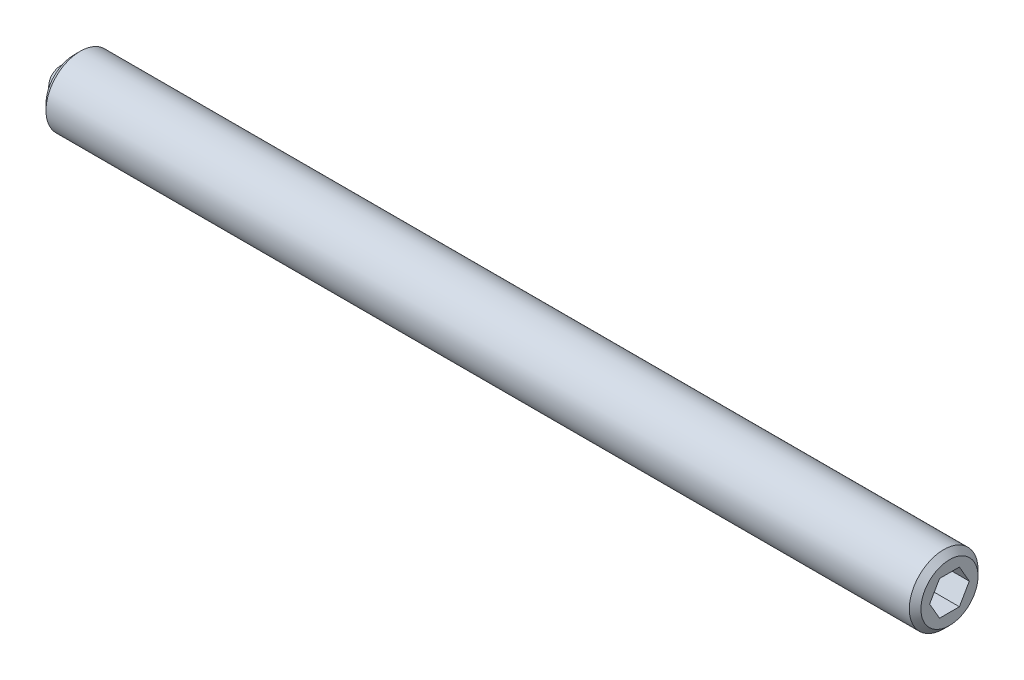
ISO-10303-21;
HEADER;
FILE_DESCRIPTION(('STEP AP214'),'2;1');
FILE_NAME('part.step','',(''),(''),'','','');
FILE_SCHEMA(('AUTOMOTIVE_DESIGN { 1 0 10303 214 1 1 1 1 }'));
ENDSEC;
DATA;
#1=APPLICATION_CONTEXT('core data for automotive mechanical design processes');
#2=APPLICATION_PROTOCOL_DEFINITION('international standard','automotive_design',2000,#1);
#3=PRODUCT_CONTEXT('',#1,'mechanical');
#4=PRODUCT('Part','Part','',(#3));
#5=PRODUCT_RELATED_PRODUCT_CATEGORY('part','',(#4));
#6=PRODUCT_DEFINITION_FORMATION('','',#4);
#7=PRODUCT_DEFINITION_CONTEXT('part definition',#1,'design');
#8=PRODUCT_DEFINITION('design','',#6,#7);
#9=PRODUCT_DEFINITION_SHAPE('','',#8);
#10=(LENGTH_UNIT() NAMED_UNIT(*) SI_UNIT(.MILLI.,.METRE.));
#11=(NAMED_UNIT(*) PLANE_ANGLE_UNIT() SI_UNIT($,.RADIAN.));
#12=(NAMED_UNIT(*) SI_UNIT($,.STERADIAN.) SOLID_ANGLE_UNIT());
#13=UNCERTAINTY_MEASURE_WITH_UNIT(LENGTH_MEASURE(1.E-05),#10,'distance_accuracy_value','');
#14=(GEOMETRIC_REPRESENTATION_CONTEXT(3) GLOBAL_UNCERTAINTY_ASSIGNED_CONTEXT((#13)) GLOBAL_UNIT_ASSIGNED_CONTEXT((#10,
#11,#12)) REPRESENTATION_CONTEXT('',''));
#15=CARTESIAN_POINT('',(0.,0.,0.));
#16=DIRECTION('',(0.,0.,1.));
#17=DIRECTION('',(1.,0.,0.));
#18=AXIS2_PLACEMENT_3D('',#15,#16,#17);
#19=CARTESIAN_POINT('',(0.,0.,0.));
#20=DIRECTION('',(0.,-1.,0.));
#21=DIRECTION('',(0.,0.,-1.));
#22=AXIS2_PLACEMENT_3D('',#19,#20,#21);
#23=SPHERICAL_SURFACE('',#22,0.8);
#24=CARTESIAN_POINT('',(0.,-0.8,0.));
#25=VERTEX_POINT('',#24);
#26=VERTEX_LOOP('',#25);
#27=FACE_BOUND('',#26,.T.);
#28=ADVANCED_FACE('F41',(#27),#23,.T.);
#29=CLOSED_SHELL('',(#28));
#30=MANIFOLD_SOLID_BREP('B2',#29);
#31=CARTESIAN_POINT('',(38.2,0.,0.));
#32=DIRECTION('',(-1.,0.,0.));
#33=DIRECTION('',(0.,0.,1.));
#34=AXIS2_PLACEMENT_3D('',#31,#32,#33);
#35=CYLINDRICAL_SURFACE('',#34,1.5);
#36=CARTESIAN_POINT('',(37.946,0.,0.));
#37=DIRECTION('',(1.,0.,0.));
#38=DIRECTION('',(0.,0.,-1.));
#39=AXIS2_PLACEMENT_3D('',#36,#37,#38);
#40=CIRCLE('',#39,1.5);
#41=CARTESIAN_POINT('',(37.946,0.,-1.5));
#42=VERTEX_POINT('',#41);
#43=EDGE_CURVE('E39',#42,#42,#40,.F.);
#44=ORIENTED_EDGE('',*,*,#43,.T.);
#45=EDGE_LOOP('',(#44));
#46=FACE_BOUND('',#45,.T.);
#47=CARTESIAN_POINT('',(0.253999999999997,0.,0.));
#48=DIRECTION('',(1.,0.,0.));
#49=DIRECTION('',(0.,0.,-1.));
#50=AXIS2_PLACEMENT_3D('',#47,#48,#49);
#51=CIRCLE('',#50,1.5);
#52=CARTESIAN_POINT('',(0.253999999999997,0.,-1.5));
#53=VERTEX_POINT('',#52);
#54=EDGE_CURVE('E157',#53,#53,#51,.T.);
#55=ORIENTED_EDGE('',*,*,#54,.T.);
#56=EDGE_LOOP('',(#55));
#57=FACE_BOUND('',#56,.T.);
#58=ADVANCED_FACE('F54',(#46,#57),#35,.T.);
#59=CARTESIAN_POINT('',(38.2,0.,0.));
#60=DIRECTION('',(1.,0.,0.));
#61=DIRECTION('',(0.,0.,-1.));
#62=AXIS2_PLACEMENT_3D('',#59,#60,#61);
#63=PLANE('',#62);
#64=DIRECTION('',(0.,0.866025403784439,-0.5));
#65=VECTOR('',#64,1.);
#66=CARTESIAN_POINT('',(38.2,-0.75,-0.43301270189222));
#67=LINE('',#66,#65);
#68=CARTESIAN_POINT('',(38.2,-0.75,-0.43301270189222));
#69=VERTEX_POINT('',#68);
#70=CARTESIAN_POINT('',(38.2,0.,-0.866025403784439));
#71=VERTEX_POINT('',#70);
#72=EDGE_CURVE('E69',#69,#71,#67,.T.);
#73=ORIENTED_EDGE('',*,*,#72,.F.);
#74=DIRECTION('',(0.,0.,-1.));
#75=VECTOR('',#74,1.);
#76=CARTESIAN_POINT('',(38.2,-0.75,0.433012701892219));
#77=LINE('',#76,#75);
#78=CARTESIAN_POINT('',(38.2,-0.75,0.433012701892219));
#79=VERTEX_POINT('',#78);
#80=EDGE_CURVE('E153',#79,#69,#77,.T.);
#81=ORIENTED_EDGE('',*,*,#80,.F.);
#82=DIRECTION('',(0.,-0.866025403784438,-0.5));
#83=VECTOR('',#82,1.);
#84=CARTESIAN_POINT('',(38.2,0.,0.866025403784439));
#85=LINE('',#84,#83);
#86=CARTESIAN_POINT('',(38.2,0.,0.866025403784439));
#87=VERTEX_POINT('',#86);
#88=EDGE_CURVE('E151',#87,#79,#85,.T.);
#89=ORIENTED_EDGE('',*,*,#88,.F.);
#90=DIRECTION('',(0.,-0.866025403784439,0.5));
#91=VECTOR('',#90,1.);
#92=CARTESIAN_POINT('',(38.2,0.75,0.433012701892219));
#93=LINE('',#92,#91);
#94=CARTESIAN_POINT('',(38.2,0.75,0.433012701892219));
#95=VERTEX_POINT('',#94);
#96=EDGE_CURVE('E117',#95,#87,#93,.T.);
#97=ORIENTED_EDGE('',*,*,#96,.F.);
#98=DIRECTION('',(0.,0.,1.));
#99=VECTOR('',#98,1.);
#100=CARTESIAN_POINT('',(38.2,0.75,-0.433012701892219));
#101=LINE('',#100,#99);
#102=CARTESIAN_POINT('',(38.2,0.75,-0.433012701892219));
#103=VERTEX_POINT('',#102);
#104=EDGE_CURVE('E147',#103,#95,#101,.T.);
#105=ORIENTED_EDGE('',*,*,#104,.F.);
#106=DIRECTION('',(0.,0.866025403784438,0.5));
#107=VECTOR('',#106,1.);
#108=CARTESIAN_POINT('',(38.2,0.,-0.866025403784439));
#109=LINE('',#108,#107);
#110=EDGE_CURVE('E143',#71,#103,#109,.T.);
#111=ORIENTED_EDGE('',*,*,#110,.F.);
#112=EDGE_LOOP('',(#73,#81,#89,#97,#105,#111));
#113=FACE_BOUND('',#112,.T.);
#114=CARTESIAN_POINT('',(38.2,0.,0.));
#115=DIRECTION('',(1.,0.,0.));
#116=DIRECTION('',(0.,0.,-1.));
#117=AXIS2_PLACEMENT_3D('',#114,#115,#116);
#118=CIRCLE('',#117,1.246);
#119=CARTESIAN_POINT('',(38.2,0.,-1.246));
#120=VERTEX_POINT('',#119);
#121=EDGE_CURVE('E62',#120,#120,#118,.T.);
#122=ORIENTED_EDGE('',*,*,#121,.T.);
#123=EDGE_LOOP('',(#122));
#124=FACE_BOUND('',#123,.T.);
#125=ADVANCED_FACE('F170',(#113,#124),#63,.T.);
#126=CARTESIAN_POINT('',(0.,0.,0.));
#127=DIRECTION('',(1.,0.,0.));
#128=DIRECTION('',(0.,0.,-1.));
#129=AXIS2_PLACEMENT_3D('',#126,#127,#128);
#130=PLANE('',#129);
#131=CARTESIAN_POINT('',(0.,0.,0.));
#132=DIRECTION('',(-1.,0.,0.));
#133=DIRECTION('',(0.,0.,1.));
#134=AXIS2_PLACEMENT_3D('',#131,#132,#133);
#135=CIRCLE('',#134,0.8);
#136=CARTESIAN_POINT('',(0.,0.,0.8));
#137=VERTEX_POINT('',#136);
#138=EDGE_CURVE('E225',#137,#137,#135,.T.);
#139=ORIENTED_EDGE('',*,*,#138,.F.);
#140=EDGE_LOOP('',(#139));
#141=FACE_BOUND('',#140,.T.);
#142=CARTESIAN_POINT('',(0.,0.,0.));
#143=DIRECTION('',(1.,0.,0.));
#144=DIRECTION('',(0.,0.,-1.));
#145=AXIS2_PLACEMENT_3D('',#142,#143,#144);
#146=CIRCLE('',#145,1.246);
#147=CARTESIAN_POINT('',(0.,0.,-1.246));
#148=VERTEX_POINT('',#147);
#149=EDGE_CURVE('E165',#148,#148,#146,.F.);
#150=ORIENTED_EDGE('',*,*,#149,.T.);
#151=EDGE_LOOP('',(#150));
#152=FACE_BOUND('',#151,.T.);
#153=ADVANCED_FACE('F182',(#141,#152),#130,.F.);
#154=CARTESIAN_POINT('',(0.253999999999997,0.,0.));
#155=DIRECTION('',(1.,0.,0.));
#156=DIRECTION('',(0.,0.,-1.));
#157=AXIS2_PLACEMENT_3D('',#154,#155,#156);
#158=CONICAL_SURFACE('',#157,1.5,0.785398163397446);
#159=ORIENTED_EDGE('',*,*,#149,.F.);
#160=EDGE_LOOP('',(#159));
#161=FACE_BOUND('',#160,.T.);
#162=ORIENTED_EDGE('',*,*,#54,.F.);
#163=EDGE_LOOP('',(#162));
#164=FACE_BOUND('',#163,.T.);
#165=ADVANCED_FACE('F174',(#161,#164),#158,.T.);
#166=CARTESIAN_POINT('',(38.2,0.,0.));
#167=DIRECTION('',(-1.,0.,0.));
#168=DIRECTION('',(0.,0.,1.));
#169=AXIS2_PLACEMENT_3D('',#166,#167,#168);
#170=CONICAL_SURFACE('',#169,1.246,0.785398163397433);
#171=ORIENTED_EDGE('',*,*,#43,.F.);
#172=EDGE_LOOP('',(#171));
#173=FACE_BOUND('',#172,.T.);
#174=ORIENTED_EDGE('',*,*,#121,.F.);
#175=EDGE_LOOP('',(#174));
#176=FACE_BOUND('',#175,.T.);
#177=ADVANCED_FACE('F56',(#173,#176),#170,.T.);
#178=CARTESIAN_POINT('',(36.2,-0.75,-0.43301270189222));
#179=DIRECTION('',(0.,-0.5,-0.866025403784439));
#180=DIRECTION('',(0.,0.866025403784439,-0.5));
#181=AXIS2_PLACEMENT_3D('',#178,#179,#180);
#182=PLANE('',#181);
#183=ORIENTED_EDGE('',*,*,#72,.T.);
#184=DIRECTION('',(1.,0.,0.));
#185=VECTOR('',#184,1.);
#186=CARTESIAN_POINT('',(36.2,0.,-0.866025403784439));
#187=LINE('',#186,#185);
#188=CARTESIAN_POINT('',(36.2,0.,-0.866025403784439));
#189=VERTEX_POINT('',#188);
#190=EDGE_CURVE('E99',#189,#71,#187,.T.);
#191=ORIENTED_EDGE('',*,*,#190,.F.);
#192=DIRECTION('',(0.,0.866025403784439,-0.5));
#193=VECTOR('',#192,1.);
#194=CARTESIAN_POINT('',(36.2,-0.75,-0.43301270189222));
#195=LINE('',#194,#193);
#196=CARTESIAN_POINT('',(36.2,-0.75,-0.43301270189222));
#197=VERTEX_POINT('',#196);
#198=EDGE_CURVE('E155',#197,#189,#195,.T.);
#199=ORIENTED_EDGE('',*,*,#198,.F.);
#200=DIRECTION('',(1.,0.,0.));
#201=VECTOR('',#200,1.);
#202=CARTESIAN_POINT('',(36.2,-0.75,-0.43301270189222));
#203=LINE('',#202,#201);
#204=EDGE_CURVE('E77',#197,#69,#203,.T.);
#205=ORIENTED_EDGE('',*,*,#204,.T.);
#206=EDGE_LOOP('',(#183,#191,#199,#205));
#207=FACE_BOUND('',#206,.T.);
#208=ADVANCED_FACE('F173',(#207),#182,.F.);
#209=CARTESIAN_POINT('',(36.2,-0.75,0.433012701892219));
#210=DIRECTION('',(0.,-1.,0.));
#211=DIRECTION('',(0.,0.,-1.));
#212=AXIS2_PLACEMENT_3D('',#209,#210,#211);
#213=PLANE('',#212);
#214=ORIENTED_EDGE('',*,*,#80,.T.);
#215=ORIENTED_EDGE('',*,*,#204,.F.);
#216=DIRECTION('',(0.,0.,-1.));
#217=VECTOR('',#216,1.);
#218=CARTESIAN_POINT('',(36.2,-0.75,0.433012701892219));
#219=LINE('',#218,#217);
#220=CARTESIAN_POINT('',(36.2,-0.75,0.433012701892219));
#221=VERTEX_POINT('',#220);
#222=EDGE_CURVE('E129',#221,#197,#219,.T.);
#223=ORIENTED_EDGE('',*,*,#222,.F.);
#224=DIRECTION('',(1.,0.,0.));
#225=VECTOR('',#224,1.);
#226=CARTESIAN_POINT('',(36.2,-0.75,0.433012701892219));
#227=LINE('',#226,#225);
#228=EDGE_CURVE('E121',#221,#79,#227,.T.);
#229=ORIENTED_EDGE('',*,*,#228,.T.);
#230=EDGE_LOOP('',(#214,#215,#223,#229));
#231=FACE_BOUND('',#230,.T.);
#232=ADVANCED_FACE('F180',(#231),#213,.F.);
#233=CARTESIAN_POINT('',(36.2,0.,0.866025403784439));
#234=DIRECTION('',(0.,-0.5,0.866025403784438));
#235=DIRECTION('',(0.,-0.866025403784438,-0.5));
#236=AXIS2_PLACEMENT_3D('',#233,#234,#235);
#237=PLANE('',#236);
#238=ORIENTED_EDGE('',*,*,#88,.T.);
#239=ORIENTED_EDGE('',*,*,#228,.F.);
#240=DIRECTION('',(0.,-0.866025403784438,-0.5));
#241=VECTOR('',#240,1.);
#242=CARTESIAN_POINT('',(36.2,0.,0.866025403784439));
#243=LINE('',#242,#241);
#244=CARTESIAN_POINT('',(36.2,0.,0.866025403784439));
#245=VERTEX_POINT('',#244);
#246=EDGE_CURVE('E125',#245,#221,#243,.T.);
#247=ORIENTED_EDGE('',*,*,#246,.F.);
#248=DIRECTION('',(1.,0.,0.));
#249=VECTOR('',#248,1.);
#250=CARTESIAN_POINT('',(36.2,0.,0.866025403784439));
#251=LINE('',#250,#249);
#252=EDGE_CURVE('E110',#245,#87,#251,.T.);
#253=ORIENTED_EDGE('',*,*,#252,.T.);
#254=EDGE_LOOP('',(#238,#239,#247,#253));
#255=FACE_BOUND('',#254,.T.);
#256=ADVANCED_FACE('F126',(#255),#237,.F.);
#257=CARTESIAN_POINT('',(36.2,0.75,0.433012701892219));
#258=DIRECTION('',(0.,0.5,0.866025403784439));
#259=DIRECTION('',(0.,-0.866025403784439,0.5));
#260=AXIS2_PLACEMENT_3D('',#257,#258,#259);
#261=PLANE('',#260);
#262=ORIENTED_EDGE('',*,*,#96,.T.);
#263=ORIENTED_EDGE('',*,*,#252,.F.);
#264=DIRECTION('',(0.,-0.866025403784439,0.5));
#265=VECTOR('',#264,1.);
#266=CARTESIAN_POINT('',(36.2,0.75,0.433012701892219));
#267=LINE('',#266,#265);
#268=CARTESIAN_POINT('',(36.2,0.75,0.433012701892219));
#269=VERTEX_POINT('',#268);
#270=EDGE_CURVE('E114',#269,#245,#267,.T.);
#271=ORIENTED_EDGE('',*,*,#270,.F.);
#272=DIRECTION('',(1.,0.,0.));
#273=VECTOR('',#272,1.);
#274=CARTESIAN_POINT('',(36.2,0.75,0.433012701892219));
#275=LINE('',#274,#273);
#276=EDGE_CURVE('E122',#269,#95,#275,.T.);
#277=ORIENTED_EDGE('',*,*,#276,.T.);
#278=EDGE_LOOP('',(#262,#263,#271,#277));
#279=FACE_BOUND('',#278,.T.);
#280=ADVANCED_FACE('F112',(#279),#261,.F.);
#281=CARTESIAN_POINT('',(36.2,0.75,-0.433012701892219));
#282=DIRECTION('',(0.,1.,0.));
#283=DIRECTION('',(0.,0.,1.));
#284=AXIS2_PLACEMENT_3D('',#281,#282,#283);
#285=PLANE('',#284);
#286=ORIENTED_EDGE('',*,*,#104,.T.);
#287=ORIENTED_EDGE('',*,*,#276,.F.);
#288=DIRECTION('',(0.,0.,1.));
#289=VECTOR('',#288,1.);
#290=CARTESIAN_POINT('',(36.2,0.75,-0.433012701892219));
#291=LINE('',#290,#289);
#292=CARTESIAN_POINT('',(36.2,0.75,-0.433012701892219));
#293=VERTEX_POINT('',#292);
#294=EDGE_CURVE('E135',#293,#269,#291,.T.);
#295=ORIENTED_EDGE('',*,*,#294,.F.);
#296=DIRECTION('',(1.,0.,0.));
#297=VECTOR('',#296,1.);
#298=CARTESIAN_POINT('',(36.2,0.75,-0.433012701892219));
#299=LINE('',#298,#297);
#300=EDGE_CURVE('E160',#293,#103,#299,.T.);
#301=ORIENTED_EDGE('',*,*,#300,.T.);
#302=EDGE_LOOP('',(#286,#287,#295,#301));
#303=FACE_BOUND('',#302,.T.);
#304=ADVANCED_FACE('F201',(#303),#285,.F.);
#305=CARTESIAN_POINT('',(36.2,0.,-0.866025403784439));
#306=DIRECTION('',(0.,0.500000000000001,-0.866025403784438));
#307=DIRECTION('',(0.,0.866025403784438,0.500000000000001));
#308=AXIS2_PLACEMENT_3D('',#305,#306,#307);
#309=PLANE('',#308);
#310=ORIENTED_EDGE('',*,*,#110,.T.);
#311=ORIENTED_EDGE('',*,*,#300,.F.);
#312=DIRECTION('',(0.,0.866025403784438,0.5));
#313=VECTOR('',#312,1.);
#314=CARTESIAN_POINT('',(36.2,0.,-0.866025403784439));
#315=LINE('',#314,#313);
#316=EDGE_CURVE('E137',#189,#293,#315,.T.);
#317=ORIENTED_EDGE('',*,*,#316,.F.);
#318=ORIENTED_EDGE('',*,*,#190,.T.);
#319=EDGE_LOOP('',(#310,#311,#317,#318));
#320=FACE_BOUND('',#319,.T.);
#321=ADVANCED_FACE('F198',(#320),#309,.F.);
#322=CARTESIAN_POINT('',(36.2,0.,0.));
#323=DIRECTION('',(1.,0.,0.));
#324=DIRECTION('',(0.,0.,-1.));
#325=AXIS2_PLACEMENT_3D('',#322,#323,#324);
#326=PLANE('',#325);
#327=ORIENTED_EDGE('',*,*,#198,.T.);
#328=ORIENTED_EDGE('',*,*,#316,.T.);
#329=ORIENTED_EDGE('',*,*,#294,.T.);
#330=ORIENTED_EDGE('',*,*,#270,.T.);
#331=ORIENTED_EDGE('',*,*,#246,.T.);
#332=ORIENTED_EDGE('',*,*,#222,.T.);
#333=EDGE_LOOP('',(#327,#328,#329,#330,#331,#332));
#334=FACE_BOUND('',#333,.T.);
#335=ADVANCED_FACE('F132',(#334),#326,.T.);
#336=CARTESIAN_POINT('',(0.8,0.,0.));
#337=DIRECTION('',(-1.,0.,0.));
#338=DIRECTION('',(0.,0.,1.));
#339=AXIS2_PLACEMENT_3D('',#336,#337,#338);
#340=CYLINDRICAL_SURFACE('',#339,0.8);
#341=CARTESIAN_POINT('',(0.8,0.,0.));
#342=DIRECTION('',(-1.,0.,0.));
#343=DIRECTION('',(0.,0.,1.));
#344=AXIS2_PLACEMENT_3D('',#341,#342,#343);
#345=CIRCLE('',#344,0.8);
#346=CARTESIAN_POINT('',(0.8,0.,0.8));
#347=VERTEX_POINT('',#346);
#348=EDGE_CURVE('E144',#347,#347,#345,.T.);
#349=ORIENTED_EDGE('',*,*,#348,.F.);
#350=EDGE_LOOP('',(#349));
#351=FACE_BOUND('',#350,.T.);
#352=ORIENTED_EDGE('',*,*,#138,.T.);
#353=EDGE_LOOP('',(#352));
#354=FACE_BOUND('',#353,.T.);
#355=ADVANCED_FACE('F214',(#351,#354),#340,.F.);
#356=CARTESIAN_POINT('',(0.8,0.,0.));
#357=DIRECTION('',(-1.,0.,0.));
#358=DIRECTION('',(0.,0.,1.));
#359=AXIS2_PLACEMENT_3D('',#356,#357,#358);
#360=PLANE('',#359);
#361=ORIENTED_EDGE('',*,*,#348,.T.);
#362=EDGE_LOOP('',(#361));
#363=FACE_BOUND('',#362,.T.);
#364=ADVANCED_FACE('F217',(#363),#360,.T.);
#365=CLOSED_SHELL('',(#58,#125,#153,#165,#177,#208,#232,#256,#280,#304,#321,#335,#355,#364));
#366=MANIFOLD_SOLID_BREP('B6',#365);
#367=ADVANCED_BREP_SHAPE_REPRESENTATION('',(#18,#30,#366),#14);
#368=SHAPE_DEFINITION_REPRESENTATION(#9,#367);
ENDSEC;
END-ISO-10303-21;
